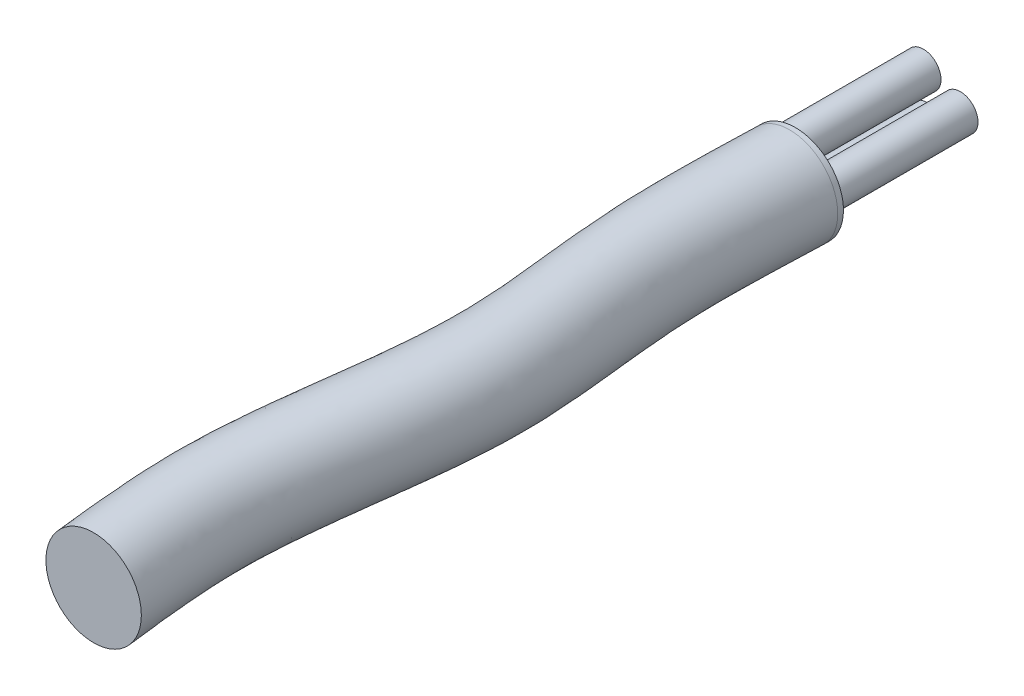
ISO-10303-21;
HEADER;
FILE_DESCRIPTION(('STEP AP214'),'2;1');
FILE_NAME('part.step','',(''),(''),'','','');
FILE_SCHEMA(('AUTOMOTIVE_DESIGN { 1 0 10303 214 1 1 1 1 }'));
ENDSEC;
DATA;
#1=APPLICATION_CONTEXT('core data for automotive mechanical design processes');
#2=APPLICATION_PROTOCOL_DEFINITION('international standard','automotive_design',2000,#1);
#3=PRODUCT_CONTEXT('',#1,'mechanical');
#4=PRODUCT('Part','Part','',(#3));
#5=PRODUCT_RELATED_PRODUCT_CATEGORY('part','',(#4));
#6=PRODUCT_DEFINITION_FORMATION('','',#4);
#7=PRODUCT_DEFINITION_CONTEXT('part definition',#1,'design');
#8=PRODUCT_DEFINITION('design','',#6,#7);
#9=PRODUCT_DEFINITION_SHAPE('','',#8);
#10=(LENGTH_UNIT() NAMED_UNIT(*) SI_UNIT(.MILLI.,.METRE.));
#11=(NAMED_UNIT(*) PLANE_ANGLE_UNIT() SI_UNIT($,.RADIAN.));
#12=(NAMED_UNIT(*) SI_UNIT($,.STERADIAN.) SOLID_ANGLE_UNIT());
#13=UNCERTAINTY_MEASURE_WITH_UNIT(LENGTH_MEASURE(1.E-05),#10,'distance_accuracy_value','');
#14=(GEOMETRIC_REPRESENTATION_CONTEXT(3) GLOBAL_UNCERTAINTY_ASSIGNED_CONTEXT((#13)) GLOBAL_UNIT_ASSIGNED_CONTEXT((#10,
#11,#12)) REPRESENTATION_CONTEXT('',''));
#15=CARTESIAN_POINT('',(0.,0.,0.));
#16=DIRECTION('',(0.,0.,1.));
#17=DIRECTION('',(1.,0.,0.));
#18=AXIS2_PLACEMENT_3D('',#15,#16,#17);
#19=CARTESIAN_POINT('',(-3.45791892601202,0.,-50.4254425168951));
#20=DIRECTION('',(0.,0.,0.999999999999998));
#21=DIRECTION('',(0.,-1.,0.));
#22=AXIS2_PLACEMENT_3D('',#19,#20,#21);
#23=PLANE('',#22);
#24=CARTESIAN_POINT('',(-0.689557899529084,-1.71483975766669,-50.4254425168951));
#25=DIRECTION('',(0.,0.,0.999999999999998));
#26=DIRECTION('',(0.,-1.,0.));
#27=AXIS2_PLACEMENT_3D('',#24,#25,#26);
#28=CIRCLE('',#27,1.27);
#29=CARTESIAN_POINT('',(-0.689557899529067,-2.98483975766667,-50.4254425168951));
#30=VERTEX_POINT('',#29);
#31=EDGE_CURVE('E24',#30,#30,#28,.F.);
#32=ORIENTED_EDGE('',*,*,#31,.F.);
#33=EDGE_LOOP('',(#32));
#34=FACE_BOUND('',#33,.T.);
#35=CARTESIAN_POINT('',(3.45791892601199,0.,-50.4254425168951));
#36=CARTESIAN_POINT('',(3.45791892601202,-6.85800000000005,-50.425442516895));
#37=CARTESIAN_POINT('',(-3.457918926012,-6.85799999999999,-50.4254425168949));
#38=CARTESIAN_POINT('',(-3.45791892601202,0.,-50.4254425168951));
#39=CARTESIAN_POINT('',(-3.457918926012,6.85799999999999,-50.425442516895));
#40=CARTESIAN_POINT('',(3.45791892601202,6.85799999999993,-50.425442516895));
#41=CARTESIAN_POINT('',(3.45791892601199,0.,-50.4254425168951));
#42=(BOUNDED_CURVE() B_SPLINE_CURVE(3,(#35,#36,#37,#38,#39,#40,#41),.UNSPECIFIED.,.T.,
.F.) B_SPLINE_CURVE_WITH_KNOTS((4,3,4),(0.,0.5,1.),
.UNSPECIFIED.) CURVE() GEOMETRIC_REPRESENTATION_ITEM() RATIONAL_B_SPLINE_CURVE((1.,
0.333333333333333,0.333333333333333,1.,0.333333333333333,0.333333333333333,1.)) REPRESENTATION_ITEM(''));
#43=CARTESIAN_POINT('',(3.45791892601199,0.,-50.4254425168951));
#44=VERTEX_POINT('',#43);
#45=EDGE_CURVE('E42',#44,#44,#42,.F.);
#46=ORIENTED_EDGE('',*,*,#45,.F.);
#47=EDGE_LOOP('',(#46));
#48=FACE_BOUND('',#47,.T.);
#49=CARTESIAN_POINT('',(1.69891733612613,0.161819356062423,-50.4254425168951));
#50=DIRECTION('',(0.,0.,0.999999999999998));
#51=DIRECTION('',(0.,-1.,0.));
#52=AXIS2_PLACEMENT_3D('',#49,#50,#51);
#53=CIRCLE('',#52,1.27);
#54=CARTESIAN_POINT('',(1.69891733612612,-1.10818064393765,-50.4254425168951));
#55=VERTEX_POINT('',#54);
#56=EDGE_CURVE('E28',#55,#55,#53,.F.);
#57=ORIENTED_EDGE('',*,*,#56,.F.);
#58=EDGE_LOOP('',(#57));
#59=FACE_BOUND('',#58,.T.);
#60=CARTESIAN_POINT('',(-0.95765205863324,1.47791795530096,-50.4254425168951));
#61=DIRECTION('',(0.,0.,0.999999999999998));
#62=DIRECTION('',(0.,-1.,0.));
#63=AXIS2_PLACEMENT_3D('',#60,#61,#62);
#64=CIRCLE('',#63,1.27);
#65=CARTESIAN_POINT('',(-0.957652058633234,0.207917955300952,-50.4254425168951));
#66=VERTEX_POINT('',#65);
#67=EDGE_CURVE('E10',#66,#66,#64,.F.);
#68=ORIENTED_EDGE('',*,*,#67,.F.);
#69=EDGE_LOOP('',(#68));
#70=FACE_BOUND('',#69,.T.);
#71=ADVANCED_FACE('F15',(#34,#48,#59,#70),#23,.F.);
#72=CARTESIAN_POINT('',(3.42899999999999,0.,0.));
#73=CARTESIAN_POINT('',(3.07501958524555,0.,-2.99527313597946));
#74=CARTESIAN_POINT('',(2.36671042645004,0.,-8.98876686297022));
#75=CARTESIAN_POINT('',(3.43309907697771,0.,-17.6937503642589));
#76=CARTESIAN_POINT('',(4.8285147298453,0.,-28.358811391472));
#77=CARTESIAN_POINT('',(3.02028988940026,0.,-38.8403067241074));
#78=CARTESIAN_POINT('',(3.3120914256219,0.,-46.2920632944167));
#79=CARTESIAN_POINT('',(3.45791892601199,0.,-50.0160705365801));
#80=CARTESIAN_POINT('',(3.42900000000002,6.85799999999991,0.));
#81=CARTESIAN_POINT('',(3.07501958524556,6.85799999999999,-2.99527313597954));
#82=CARTESIAN_POINT('',(2.36671042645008,6.85800000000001,-8.98876686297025));
#83=CARTESIAN_POINT('',(3.43309907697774,6.85799999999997,-17.6937503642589));
#84=CARTESIAN_POINT('',(4.82851472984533,6.85799999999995,-28.358811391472));
#85=CARTESIAN_POINT('',(3.02028988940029,6.85799999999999,-38.8403067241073));
#86=CARTESIAN_POINT('',(3.31209142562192,6.85799999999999,-46.2920632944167));
#87=CARTESIAN_POINT('',(3.45791892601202,6.85799999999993,-50.0160705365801));
#88=CARTESIAN_POINT('',(-3.42899999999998,6.85799999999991,0.));
#89=CARTESIAN_POINT('',(-3.78241312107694,6.85799999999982,-3.23216219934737));
#90=CARTESIAN_POINT('',(-4.48958713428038,6.85799999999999,-9.69966716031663));
#91=CARTESIAN_POINT('',(-3.12921139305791,6.85799999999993,-19.8261971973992));
#92=CARTESIAN_POINT('',(-2.06789855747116,6.85800000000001,-28.7395737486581));
#93=CARTESIAN_POINT('',(-3.80122567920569,6.85799999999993,-39.1997907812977));
#94=CARTESIAN_POINT('',(-3.57231619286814,6.85799999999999,-46.4924867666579));
#95=CARTESIAN_POINT('',(-3.457918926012,6.85799999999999,-50.1370036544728));
#96=CARTESIAN_POINT('',(-3.429,0.,0.));
#97=CARTESIAN_POINT('',(-3.78241312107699,0.,-3.2321621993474));
#98=CARTESIAN_POINT('',(-4.48958713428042,0.,-9.69966716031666));
#99=CARTESIAN_POINT('',(-3.12921139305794,0.,-19.8261971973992));
#100=CARTESIAN_POINT('',(-2.06789855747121,0.,-28.7395737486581));
#101=CARTESIAN_POINT('',(-3.80122567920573,0.,-39.1997907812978));
#102=CARTESIAN_POINT('',(-3.57231619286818,0.,-46.492486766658));
#103=CARTESIAN_POINT('',(-3.45791892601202,0.,-50.1370036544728));
#104=CARTESIAN_POINT('',(-3.42900000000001,-6.85800000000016,0.));
#105=CARTESIAN_POINT('',(-3.78241312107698,-6.85800000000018,-3.23216219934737));
#106=CARTESIAN_POINT('',(-4.48958713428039,-6.85799999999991,-9.69966716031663));
#107=CARTESIAN_POINT('',(-3.12921139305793,-6.85800000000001,-19.8261971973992));
#108=CARTESIAN_POINT('',(-2.06789855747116,-6.85800000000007,-28.7395737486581));
#109=CARTESIAN_POINT('',(-3.80122567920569,-6.85800000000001,-39.1997907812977));
#110=CARTESIAN_POINT('',(-3.57231619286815,-6.85800000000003,-46.4924867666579));
#111=CARTESIAN_POINT('',(-3.457918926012,-6.85799999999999,-50.1370036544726));
#112=CARTESIAN_POINT('',(3.42900000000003,-6.85800000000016,0.));
#113=CARTESIAN_POINT('',(3.07501958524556,-6.85800000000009,-2.99527313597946));
#114=CARTESIAN_POINT('',(2.36671042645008,-6.85800000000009,-8.98876686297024));
#115=CARTESIAN_POINT('',(3.4330990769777,-6.85799999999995,-17.6937503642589));
#116=CARTESIAN_POINT('',(4.82851472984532,-6.85799999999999,-28.358811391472));
#117=CARTESIAN_POINT('',(3.02028988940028,-6.85799999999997,-38.8403067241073));
#118=CARTESIAN_POINT('',(3.31209142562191,-6.85799999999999,-46.2920632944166));
#119=CARTESIAN_POINT('',(3.45791892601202,-6.85800000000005,-50.01607053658));
#120=CARTESIAN_POINT('',(3.42899999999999,0.,0.));
#121=CARTESIAN_POINT('',(3.07501958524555,0.,-2.99527313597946));
#122=CARTESIAN_POINT('',(2.36671042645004,0.,-8.98876686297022));
#123=CARTESIAN_POINT('',(3.43309907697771,0.,-17.6937503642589));
#124=CARTESIAN_POINT('',(4.8285147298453,0.,-28.358811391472));
#125=CARTESIAN_POINT('',(3.02028988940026,0.,-38.8403067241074));
#126=CARTESIAN_POINT('',(3.3120914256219,0.,-46.2920632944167));
#127=CARTESIAN_POINT('',(3.45791892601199,0.,-50.0160705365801));
#128=(BOUNDED_SURFACE() B_SPLINE_SURFACE(3,3,((#72,#73,#74,#75,#76,#77,#78,#79),(#80,#81,#82,
#83,#84,#85,#86,#87),(#88,#89,#90,#91,#92,#93,#94,#95),(#96,#97,#98,#99,#100,#101,#102,#103),
(#104,#105,#106,#107,#108,#109,#110,#111),(#112,#113,#114,#115,#116,#117,#118,#119),(#120,#121,
#122,#123,#124,#125,#126,#127)),.UNSPECIFIED.,.T.,.F.,.F.) B_SPLINE_SURFACE_WITH_KNOTS((4,3,4),
(4,1,1,1,1,4),(0.,0.5,1.),(0.,0.185525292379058,0.371233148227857,0.559124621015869,
0.779673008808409,1.),
.UNSPECIFIED.) GEOMETRIC_REPRESENTATION_ITEM() RATIONAL_B_SPLINE_SURFACE(((1.,1.,1.,1.,1.,1.,1.,
1.),(0.333333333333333,0.333333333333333,0.333333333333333,0.333333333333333,0.333333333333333,
0.333333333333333,0.333333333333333,0.333333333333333),(0.333333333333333,0.333333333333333,
0.333333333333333,0.333333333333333,0.333333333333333,0.333333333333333,0.333333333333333,
0.333333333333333),(1.,1.,1.,1.,1.,1.,1.,1.),(0.333333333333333,0.333333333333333,
0.333333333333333,0.333333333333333,0.333333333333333,0.333333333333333,0.333333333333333,
0.333333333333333),(0.333333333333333,0.333333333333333,0.333333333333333,0.333333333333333,
0.333333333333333,0.333333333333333,0.333333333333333,0.333333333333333),(1.,1.,1.,1.,1.,1.,1.,1.))) REPRESENTATION_ITEM('') SURFACE());
#129=CARTESIAN_POINT('',(0.,0.,0.));
#130=DIRECTION('',(0.,0.,0.999999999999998));
#131=DIRECTION('',(1.,0.,0.));
#132=AXIS2_PLACEMENT_3D('',#129,#130,#131);
#133=CIRCLE('',#132,3.429);
#134=CARTESIAN_POINT('',(3.429,0.,0.));
#135=VERTEX_POINT('',#134);
#136=EDGE_CURVE('E32',#135,#135,#133,.T.);
#137=CARTESIAN_POINT('',(3.45791892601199,0.,-50.0160705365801));
#138=CARTESIAN_POINT('',(3.45791892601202,6.85799999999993,-50.0160705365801));
#139=CARTESIAN_POINT('',(-3.457918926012,6.85799999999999,-50.1370036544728));
#140=CARTESIAN_POINT('',(-3.45791892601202,0.,-50.1370036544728));
#141=CARTESIAN_POINT('',(-3.457918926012,-6.85799999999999,-50.1370036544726));
#142=CARTESIAN_POINT('',(3.45791892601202,-6.85800000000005,-50.01607053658));
#143=CARTESIAN_POINT('',(3.45791892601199,0.,-50.0160705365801));
#144=(BOUNDED_CURVE() B_SPLINE_CURVE(3,(#137,#138,#139,#140,#141,#142,#143),.UNSPECIFIED.,.T.,
.F.) B_SPLINE_CURVE_WITH_KNOTS((4,3,4),(0.,0.5,1.),
.UNSPECIFIED.) CURVE() GEOMETRIC_REPRESENTATION_ITEM() RATIONAL_B_SPLINE_CURVE((1.,
0.333333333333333,0.333333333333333,1.,0.333333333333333,0.333333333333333,1.)) REPRESENTATION_ITEM(''));
#145=CARTESIAN_POINT('',(3.45791892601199,0.,-50.0160705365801));
#146=VERTEX_POINT('',#145);
#147=EDGE_CURVE('E37',#146,#146,#144,.F.);
#148=ORIENTED_EDGE('',*,*,#136,.F.);
#149=EDGE_LOOP('',(#148));
#150=FACE_BOUND('',#149,.T.);
#151=ORIENTED_EDGE('',*,*,#147,.F.);
#152=EDGE_LOOP('',(#151));
#153=FACE_BOUND('',#152,.T.);
#154=ADVANCED_FACE('F17',(#150,#153),#128,.F.);
#155=CARTESIAN_POINT('',(0.,0.,0.));
#156=DIRECTION('',(0.,0.,0.999999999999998));
#157=DIRECTION('',(1.,0.,0.));
#158=AXIS2_PLACEMENT_3D('',#155,#156,#157);
#159=PLANE('',#158);
#160=ORIENTED_EDGE('',*,*,#136,.T.);
#161=EDGE_LOOP('',(#160));
#162=FACE_BOUND('',#161,.T.);
#163=ADVANCED_FACE('F82',(#162),#159,.T.);
#164=CARTESIAN_POINT('',(3.45791892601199,0.,-50.0160705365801));
#165=CARTESIAN_POINT('',(3.45791892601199,0.,-50.4254425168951));
#166=CARTESIAN_POINT('',(3.45791892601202,-6.85800000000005,-50.01607053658));
#167=CARTESIAN_POINT('',(3.45791892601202,-6.85800000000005,-50.425442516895));
#168=CARTESIAN_POINT('',(-3.457918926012,-6.85799999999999,-50.1370036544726));
#169=CARTESIAN_POINT('',(-3.457918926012,-6.85799999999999,-50.4254425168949));
#170=CARTESIAN_POINT('',(-3.45791892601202,0.,-50.1370036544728));
#171=CARTESIAN_POINT('',(-3.45791892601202,0.,-50.4254425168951));
#172=CARTESIAN_POINT('',(-3.457918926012,6.85799999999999,-50.1370036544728));
#173=CARTESIAN_POINT('',(-3.457918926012,6.85799999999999,-50.425442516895));
#174=CARTESIAN_POINT('',(3.45791892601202,6.85799999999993,-50.0160705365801));
#175=CARTESIAN_POINT('',(3.45791892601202,6.85799999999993,-50.425442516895));
#176=CARTESIAN_POINT('',(3.45791892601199,0.,-50.0160705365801));
#177=CARTESIAN_POINT('',(3.45791892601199,0.,-50.4254425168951));
#178=(BOUNDED_SURFACE() B_SPLINE_SURFACE(3,1,((#164,#165),(#166,#167),(#168,#169),(#170,#171),
(#172,#173),(#174,#175),(#176,#177)),.UNSPECIFIED.,.T.,.F.,.F.) B_SPLINE_SURFACE_WITH_KNOTS((4,
3,4),(2,2),(0.,0.5,1.),(0.,1.),
.UNSPECIFIED.) GEOMETRIC_REPRESENTATION_ITEM() RATIONAL_B_SPLINE_SURFACE(((1.,1.),
(0.333333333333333,0.333333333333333),(0.333333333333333,0.333333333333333),(1.,1.),
(0.333333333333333,0.333333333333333),(0.333333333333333,0.333333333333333),(1.,1.))) REPRESENTATION_ITEM('') SURFACE());
#179=ORIENTED_EDGE('',*,*,#147,.T.);
#180=EDGE_LOOP('',(#179));
#181=FACE_BOUND('',#180,.T.);
#182=ORIENTED_EDGE('',*,*,#45,.T.);
#183=EDGE_LOOP('',(#182));
#184=FACE_BOUND('',#183,.T.);
#185=ADVANCED_FACE('F88',(#181,#184),#178,.T.);
#186=CARTESIAN_POINT('',(1.69891733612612,0.16181935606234,-60.5854425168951));
#187=DIRECTION('',(0.,0.,0.999999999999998));
#188=DIRECTION('',(0.,-1.,0.));
#189=AXIS2_PLACEMENT_3D('',#186,#187,#188);
#190=CYLINDRICAL_SURFACE('',#189,1.27);
#191=CARTESIAN_POINT('',(1.69891733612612,0.16181935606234,-60.5854425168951));
#192=DIRECTION('',(0.,0.,-0.999999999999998));
#193=DIRECTION('',(0.,1.,0.));
#194=AXIS2_PLACEMENT_3D('',#191,#192,#193);
#195=CIRCLE('',#194,1.27);
#196=CARTESIAN_POINT('',(1.69891733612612,-1.10818064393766,-60.5854425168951));
#197=VERTEX_POINT('',#196);
#198=EDGE_CURVE('E50',#197,#197,#195,.T.);
#199=CARTESIAN_POINT('',(1.69891733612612,-1.10818064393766,-60.5854425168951));
#200=CARTESIAN_POINT('',(1.69891733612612,-1.10818064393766,-60.4796091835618));
#201=CARTESIAN_POINT('',(1.69891733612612,-1.10818064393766,-60.3737758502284));
#202=CARTESIAN_POINT('',(1.69891733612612,-1.10818064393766,-60.1621091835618));
#203=CARTESIAN_POINT('',(1.69891733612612,-1.10818064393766,-60.0562758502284));
#204=CARTESIAN_POINT('',(1.69891733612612,-1.10818064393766,-59.8446091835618));
#205=CARTESIAN_POINT('',(1.69891733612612,-1.10818064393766,-59.7387758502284));
#206=CARTESIAN_POINT('',(1.69891733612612,-1.10818064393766,-59.5271091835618));
#207=CARTESIAN_POINT('',(1.69891733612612,-1.10818064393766,-59.4212758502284));
#208=CARTESIAN_POINT('',(1.69891733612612,-1.10818064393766,-59.2096091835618));
#209=CARTESIAN_POINT('',(1.69891733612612,-1.10818064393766,-59.1037758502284));
#210=CARTESIAN_POINT('',(1.69891733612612,-1.10818064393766,-58.8921091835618));
#211=CARTESIAN_POINT('',(1.69891733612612,-1.10818064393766,-58.7862758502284));
#212=CARTESIAN_POINT('',(1.69891733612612,-1.10818064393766,-58.5746091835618));
#213=CARTESIAN_POINT('',(1.69891733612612,-1.10818064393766,-58.4687758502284));
#214=CARTESIAN_POINT('',(1.69891733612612,-1.10818064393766,-58.2571091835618));
#215=CARTESIAN_POINT('',(1.69891733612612,-1.10818064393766,-58.1512758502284));
#216=CARTESIAN_POINT('',(1.69891733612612,-1.10818064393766,-57.9396091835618));
#217=CARTESIAN_POINT('',(1.69891733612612,-1.10818064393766,-57.8337758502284));
#218=CARTESIAN_POINT('',(1.69891733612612,-1.10818064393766,-57.6221091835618));
#219=CARTESIAN_POINT('',(1.69891733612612,-1.10818064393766,-57.5162758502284));
#220=CARTESIAN_POINT('',(1.69891733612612,-1.10818064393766,-57.3046091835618));
#221=CARTESIAN_POINT('',(1.69891733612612,-1.10818064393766,-57.1987758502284));
#222=CARTESIAN_POINT('',(1.69891733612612,-1.10818064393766,-56.9871091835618));
#223=CARTESIAN_POINT('',(1.69891733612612,-1.10818064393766,-56.8812758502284));
#224=CARTESIAN_POINT('',(1.69891733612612,-1.10818064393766,-56.6696091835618));
#225=CARTESIAN_POINT('',(1.69891733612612,-1.10818064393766,-56.5637758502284));
#226=CARTESIAN_POINT('',(1.69891733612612,-1.10818064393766,-56.3521091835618));
#227=CARTESIAN_POINT('',(1.69891733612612,-1.10818064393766,-56.2462758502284));
#228=CARTESIAN_POINT('',(1.69891733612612,-1.10818064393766,-56.0346091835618));
#229=CARTESIAN_POINT('',(1.69891733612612,-1.10818064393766,-55.9287758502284));
#230=CARTESIAN_POINT('',(1.69891733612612,-1.10818064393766,-55.7171091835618));
#231=CARTESIAN_POINT('',(1.69891733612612,-1.10818064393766,-55.6112758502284));
#232=CARTESIAN_POINT('',(1.69891733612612,-1.10818064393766,-55.3996091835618));
#233=CARTESIAN_POINT('',(1.69891733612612,-1.10818064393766,-55.2937758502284));
#234=CARTESIAN_POINT('',(1.69891733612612,-1.10818064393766,-55.0821091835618));
#235=CARTESIAN_POINT('',(1.69891733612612,-1.10818064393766,-54.9762758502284));
#236=CARTESIAN_POINT('',(1.69891733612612,-1.10818064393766,-54.7646091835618));
#237=CARTESIAN_POINT('',(1.69891733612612,-1.10818064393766,-54.6587758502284));
#238=CARTESIAN_POINT('',(1.69891733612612,-1.10818064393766,-54.4471091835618));
#239=CARTESIAN_POINT('',(1.69891733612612,-1.10818064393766,-54.3412758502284));
#240=CARTESIAN_POINT('',(1.69891733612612,-1.10818064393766,-54.1296091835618));
#241=CARTESIAN_POINT('',(1.69891733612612,-1.10818064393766,-54.0237758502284));
#242=CARTESIAN_POINT('',(1.69891733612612,-1.10818064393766,-53.8121091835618));
#243=CARTESIAN_POINT('',(1.69891733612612,-1.10818064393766,-53.7062758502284));
#244=CARTESIAN_POINT('',(1.69891733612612,-1.10818064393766,-53.4946091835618));
#245=CARTESIAN_POINT('',(1.69891733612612,-1.10818064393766,-53.3887758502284));
#246=CARTESIAN_POINT('',(1.69891733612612,-1.10818064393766,-53.1771091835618));
#247=CARTESIAN_POINT('',(1.69891733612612,-1.10818064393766,-53.0712758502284));
#248=CARTESIAN_POINT('',(1.69891733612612,-1.10818064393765,-52.8596091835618));
#249=CARTESIAN_POINT('',(1.69891733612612,-1.10818064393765,-52.7537758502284));
#250=CARTESIAN_POINT('',(1.69891733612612,-1.10818064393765,-52.5421091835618));
#251=CARTESIAN_POINT('',(1.69891733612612,-1.10818064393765,-52.4362758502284));
#252=CARTESIAN_POINT('',(1.69891733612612,-1.10818064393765,-52.2246091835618));
#253=CARTESIAN_POINT('',(1.69891733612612,-1.10818064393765,-52.1187758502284));
#254=CARTESIAN_POINT('',(1.69891733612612,-1.10818064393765,-51.9071091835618));
#255=CARTESIAN_POINT('',(1.69891733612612,-1.10818064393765,-51.8012758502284));
#256=CARTESIAN_POINT('',(1.69891733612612,-1.10818064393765,-51.5896091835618));
#257=CARTESIAN_POINT('',(1.69891733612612,-1.10818064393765,-51.4837758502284));
#258=CARTESIAN_POINT('',(1.69891733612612,-1.10818064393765,-51.2721091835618));
#259=CARTESIAN_POINT('',(1.69891733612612,-1.10818064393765,-51.1662758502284));
#260=CARTESIAN_POINT('',(1.69891733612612,-1.10818064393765,-50.9546091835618));
#261=CARTESIAN_POINT('',(1.69891733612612,-1.10818064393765,-50.8487758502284));
#262=CARTESIAN_POINT('',(1.69891733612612,-1.10818064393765,-50.6371091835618));
#263=CARTESIAN_POINT('',(1.69891733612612,-1.10818064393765,-50.5312758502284));
#264=CARTESIAN_POINT('',(1.69891733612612,-1.10818064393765,-50.4254425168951));
#265=B_SPLINE_CURVE_WITH_KNOTS('',3,(#199,#200,#201,#202,#203,#204,#205,#206,#207,#208,#209,
#210,#211,#212,#213,#214,#215,#216,#217,#218,#219,#220,#221,#222,#223,#224,#225,#226,#227,#228,
#229,#230,#231,#232,#233,#234,#235,#236,#237,#238,#239,#240,#241,#242,#243,#244,#245,#246,#247,
#248,#249,#250,#251,#252,#253,#254,#255,#256,#257,#258,#259,#260,#261,#262,#263,#264),
.UNSPECIFIED.,.F.,.F.,(4,2,2,2,2,2,2,2,2,2,2,2,2,2,2,2,2,2,2,2,2,2,2,2,2,2,2,2,2,2,2,2,4),(0.,
0.317500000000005,0.635000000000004,0.952500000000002,1.27000000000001,1.58750000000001,1.905,
2.2225,2.54,2.85750000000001,3.175,3.4925,3.81,4.12750000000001,4.445,4.7625,5.08,
5.39750000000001,5.71500000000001,6.0325,6.35,6.66750000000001,6.985,7.3025,7.62,
7.93750000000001,8.25500000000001,8.5725,8.89000000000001,9.20750000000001,9.52500000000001,
9.8425,10.16),.UNSPECIFIED.);
#266=EDGE_CURVE('BSEAM97',#197,#55,#265,.T.);
#267=ORIENTED_EDGE('',*,*,#198,.F.);
#268=ORIENTED_EDGE('',*,*,#56,.T.);
#269=ORIENTED_EDGE('',*,*,#266,.T.);
#270=ORIENTED_EDGE('',*,*,#266,.F.);
#271=EDGE_LOOP('',(#267,#269,#268,#270));
#272=FACE_BOUND('',#271,.T.);
#273=ADVANCED_FACE('F97',(#272),#190,.T.);
#274=CARTESIAN_POINT('',(1.69891733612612,0.16181935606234,-60.5854425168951));
#275=DIRECTION('',(0.,0.,-0.999999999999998));
#276=DIRECTION('',(0.,1.,0.));
#277=AXIS2_PLACEMENT_3D('',#274,#275,#276);
#278=PLANE('',#277);
#279=ORIENTED_EDGE('',*,*,#198,.T.);
#280=EDGE_LOOP('',(#279));
#281=FACE_BOUND('',#280,.T.);
#282=ADVANCED_FACE('F109',(#281),#278,.T.);
#283=CARTESIAN_POINT('',(-0.689557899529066,-1.71483975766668,-60.5854425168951));
#284=DIRECTION('',(0.,0.,0.999999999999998));
#285=DIRECTION('',(0.,-1.,0.));
#286=AXIS2_PLACEMENT_3D('',#283,#284,#285);
#287=CYLINDRICAL_SURFACE('',#286,1.27);
#288=CARTESIAN_POINT('',(-0.689557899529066,-1.71483975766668,-60.5854425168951));
#289=DIRECTION('',(0.,0.,-0.999999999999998));
#290=DIRECTION('',(0.,1.,0.));
#291=AXIS2_PLACEMENT_3D('',#288,#289,#290);
#292=CIRCLE('',#291,1.27);
#293=CARTESIAN_POINT('',(-0.689557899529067,-2.98483975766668,-60.5854425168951));
#294=VERTEX_POINT('',#293);
#295=EDGE_CURVE('E56',#294,#294,#292,.T.);
#296=CARTESIAN_POINT('',(-0.689557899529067,-2.98483975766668,-60.5854425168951));
#297=CARTESIAN_POINT('',(-0.689557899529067,-2.98483975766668,-60.4796091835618));
#298=CARTESIAN_POINT('',(-0.689557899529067,-2.98483975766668,-60.3737758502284));
#299=CARTESIAN_POINT('',(-0.689557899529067,-2.98483975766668,-60.1621091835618));
#300=CARTESIAN_POINT('',(-0.689557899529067,-2.98483975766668,-60.0562758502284));
#301=CARTESIAN_POINT('',(-0.689557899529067,-2.98483975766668,-59.8446091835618));
#302=CARTESIAN_POINT('',(-0.689557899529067,-2.98483975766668,-59.7387758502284));
#303=CARTESIAN_POINT('',(-0.689557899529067,-2.98483975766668,-59.5271091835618));
#304=CARTESIAN_POINT('',(-0.689557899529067,-2.98483975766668,-59.4212758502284));
#305=CARTESIAN_POINT('',(-0.689557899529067,-2.98483975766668,-59.2096091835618));
#306=CARTESIAN_POINT('',(-0.689557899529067,-2.98483975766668,-59.1037758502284));
#307=CARTESIAN_POINT('',(-0.689557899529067,-2.98483975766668,-58.8921091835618));
#308=CARTESIAN_POINT('',(-0.689557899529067,-2.98483975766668,-58.7862758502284));
#309=CARTESIAN_POINT('',(-0.689557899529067,-2.98483975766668,-58.5746091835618));
#310=CARTESIAN_POINT('',(-0.689557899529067,-2.98483975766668,-58.4687758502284));
#311=CARTESIAN_POINT('',(-0.689557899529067,-2.98483975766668,-58.2571091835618));
#312=CARTESIAN_POINT('',(-0.689557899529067,-2.98483975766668,-58.1512758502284));
#313=CARTESIAN_POINT('',(-0.689557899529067,-2.98483975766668,-57.9396091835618));
#314=CARTESIAN_POINT('',(-0.689557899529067,-2.98483975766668,-57.8337758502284));
#315=CARTESIAN_POINT('',(-0.689557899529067,-2.98483975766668,-57.6221091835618));
#316=CARTESIAN_POINT('',(-0.689557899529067,-2.98483975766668,-57.5162758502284));
#317=CARTESIAN_POINT('',(-0.689557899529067,-2.98483975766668,-57.3046091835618));
#318=CARTESIAN_POINT('',(-0.689557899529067,-2.98483975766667,-57.1987758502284));
#319=CARTESIAN_POINT('',(-0.689557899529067,-2.98483975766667,-56.9871091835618));
#320=CARTESIAN_POINT('',(-0.689557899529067,-2.98483975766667,-56.8812758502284));
#321=CARTESIAN_POINT('',(-0.689557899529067,-2.98483975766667,-56.6696091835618));
#322=CARTESIAN_POINT('',(-0.689557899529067,-2.98483975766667,-56.5637758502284));
#323=CARTESIAN_POINT('',(-0.689557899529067,-2.98483975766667,-56.3521091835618));
#324=CARTESIAN_POINT('',(-0.689557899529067,-2.98483975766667,-56.2462758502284));
#325=CARTESIAN_POINT('',(-0.689557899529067,-2.98483975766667,-56.0346091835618));
#326=CARTESIAN_POINT('',(-0.689557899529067,-2.98483975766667,-55.9287758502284));
#327=CARTESIAN_POINT('',(-0.689557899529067,-2.98483975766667,-55.7171091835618));
#328=CARTESIAN_POINT('',(-0.689557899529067,-2.98483975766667,-55.6112758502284));
#329=CARTESIAN_POINT('',(-0.689557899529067,-2.98483975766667,-55.3996091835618));
#330=CARTESIAN_POINT('',(-0.689557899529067,-2.98483975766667,-55.2937758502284));
#331=CARTESIAN_POINT('',(-0.689557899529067,-2.98483975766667,-55.0821091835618));
#332=CARTESIAN_POINT('',(-0.689557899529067,-2.98483975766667,-54.9762758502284));
#333=CARTESIAN_POINT('',(-0.689557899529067,-2.98483975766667,-54.7646091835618));
#334=CARTESIAN_POINT('',(-0.689557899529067,-2.98483975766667,-54.6587758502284));
#335=CARTESIAN_POINT('',(-0.689557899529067,-2.98483975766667,-54.4471091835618));
#336=CARTESIAN_POINT('',(-0.689557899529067,-2.98483975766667,-54.3412758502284));
#337=CARTESIAN_POINT('',(-0.689557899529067,-2.98483975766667,-54.1296091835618));
#338=CARTESIAN_POINT('',(-0.689557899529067,-2.98483975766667,-54.0237758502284));
#339=CARTESIAN_POINT('',(-0.689557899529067,-2.98483975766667,-53.8121091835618));
#340=CARTESIAN_POINT('',(-0.689557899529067,-2.98483975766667,-53.7062758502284));
#341=CARTESIAN_POINT('',(-0.689557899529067,-2.98483975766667,-53.4946091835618));
#342=CARTESIAN_POINT('',(-0.689557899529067,-2.98483975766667,-53.3887758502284));
#343=CARTESIAN_POINT('',(-0.689557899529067,-2.98483975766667,-53.1771091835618));
#344=CARTESIAN_POINT('',(-0.689557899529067,-2.98483975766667,-53.0712758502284));
#345=CARTESIAN_POINT('',(-0.689557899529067,-2.98483975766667,-52.8596091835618));
#346=CARTESIAN_POINT('',(-0.689557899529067,-2.98483975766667,-52.7537758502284));
#347=CARTESIAN_POINT('',(-0.689557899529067,-2.98483975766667,-52.5421091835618));
#348=CARTESIAN_POINT('',(-0.689557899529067,-2.98483975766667,-52.4362758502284));
#349=CARTESIAN_POINT('',(-0.689557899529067,-2.98483975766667,-52.2246091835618));
#350=CARTESIAN_POINT('',(-0.689557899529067,-2.98483975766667,-52.1187758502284));
#351=CARTESIAN_POINT('',(-0.689557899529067,-2.98483975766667,-51.9071091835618));
#352=CARTESIAN_POINT('',(-0.689557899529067,-2.98483975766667,-51.8012758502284));
#353=CARTESIAN_POINT('',(-0.689557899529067,-2.98483975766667,-51.5896091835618));
#354=CARTESIAN_POINT('',(-0.689557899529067,-2.98483975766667,-51.4837758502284));
#355=CARTESIAN_POINT('',(-0.689557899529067,-2.98483975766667,-51.2721091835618));
#356=CARTESIAN_POINT('',(-0.689557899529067,-2.98483975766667,-51.1662758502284));
#357=CARTESIAN_POINT('',(-0.689557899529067,-2.98483975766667,-50.9546091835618));
#358=CARTESIAN_POINT('',(-0.689557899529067,-2.98483975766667,-50.8487758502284));
#359=CARTESIAN_POINT('',(-0.689557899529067,-2.98483975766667,-50.6371091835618));
#360=CARTESIAN_POINT('',(-0.689557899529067,-2.98483975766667,-50.5312758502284));
#361=CARTESIAN_POINT('',(-0.689557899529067,-2.98483975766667,-50.4254425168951));
#362=B_SPLINE_CURVE_WITH_KNOTS('',3,(#296,#297,#298,#299,#300,#301,#302,#303,#304,#305,#306,
#307,#308,#309,#310,#311,#312,#313,#314,#315,#316,#317,#318,#319,#320,#321,#322,#323,#324,#325,
#326,#327,#328,#329,#330,#331,#332,#333,#334,#335,#336,#337,#338,#339,#340,#341,#342,#343,#344,
#345,#346,#347,#348,#349,#350,#351,#352,#353,#354,#355,#356,#357,#358,#359,#360,#361),
.UNSPECIFIED.,.F.,.F.,(4,2,2,2,2,2,2,2,2,2,2,2,2,2,2,2,2,2,2,2,2,2,2,2,2,2,2,2,2,2,2,2,4),(0.,
0.317500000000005,0.635000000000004,0.952500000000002,1.27000000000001,1.58750000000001,1.905,
2.2225,2.54,2.85750000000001,3.175,3.4925,3.81,4.12750000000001,4.445,4.7625,5.08,
5.39750000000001,5.71500000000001,6.0325,6.35,6.66750000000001,6.985,7.3025,7.62,
7.93750000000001,8.25500000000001,8.5725,8.89000000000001,9.20750000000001,9.52500000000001,
9.8425,10.16),.UNSPECIFIED.);
#363=EDGE_CURVE('BSEAM76',#294,#30,#362,.T.);
#364=ORIENTED_EDGE('',*,*,#295,.F.);
#365=ORIENTED_EDGE('',*,*,#31,.T.);
#366=ORIENTED_EDGE('',*,*,#363,.T.);
#367=ORIENTED_EDGE('',*,*,#363,.F.);
#368=EDGE_LOOP('',(#364,#366,#365,#367));
#369=FACE_BOUND('',#368,.T.);
#370=ADVANCED_FACE('F76',(#369),#287,.T.);
#371=CARTESIAN_POINT('',(-0.689557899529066,-1.71483975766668,-60.5854425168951));
#372=DIRECTION('',(0.,0.,-0.999999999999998));
#373=DIRECTION('',(0.,1.,0.));
#374=AXIS2_PLACEMENT_3D('',#371,#372,#373);
#375=PLANE('',#374);
#376=ORIENTED_EDGE('',*,*,#295,.T.);
#377=EDGE_LOOP('',(#376));
#378=FACE_BOUND('',#377,.T.);
#379=ADVANCED_FACE('F67',(#378),#375,.T.);
#380=CARTESIAN_POINT('',(-0.957652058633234,1.47791795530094,-60.5854425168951));
#381=DIRECTION('',(0.,0.,0.999999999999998));
#382=DIRECTION('',(0.,-1.,0.));
#383=AXIS2_PLACEMENT_3D('',#380,#381,#382);
#384=CYLINDRICAL_SURFACE('',#383,1.27);
#385=CARTESIAN_POINT('',(-0.957652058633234,1.47791795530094,-60.5854425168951));
#386=DIRECTION('',(0.,0.,-0.999999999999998));
#387=DIRECTION('',(0.,1.,0.));
#388=AXIS2_PLACEMENT_3D('',#385,#386,#387);
#389=CIRCLE('',#388,1.27);
#390=CARTESIAN_POINT('',(-0.957652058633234,0.207917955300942,-60.5854425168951));
#391=VERTEX_POINT('',#390);
#392=EDGE_CURVE('E59',#391,#391,#389,.T.);
#393=CARTESIAN_POINT('',(-0.957652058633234,0.207917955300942,-60.5854425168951));
#394=CARTESIAN_POINT('',(-0.957652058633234,0.207917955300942,-60.4796091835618));
#395=CARTESIAN_POINT('',(-0.957652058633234,0.207917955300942,-60.3737758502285));
#396=CARTESIAN_POINT('',(-0.957652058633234,0.207917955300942,-60.1621091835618));
#397=CARTESIAN_POINT('',(-0.957652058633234,0.207917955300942,-60.0562758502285));
#398=CARTESIAN_POINT('',(-0.957652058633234,0.207917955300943,-59.8446091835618));
#399=CARTESIAN_POINT('',(-0.957652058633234,0.207917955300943,-59.7387758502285));
#400=CARTESIAN_POINT('',(-0.957652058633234,0.207917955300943,-59.5271091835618));
#401=CARTESIAN_POINT('',(-0.957652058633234,0.207917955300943,-59.4212758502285));
#402=CARTESIAN_POINT('',(-0.957652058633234,0.207917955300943,-59.2096091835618));
#403=CARTESIAN_POINT('',(-0.957652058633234,0.207917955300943,-59.1037758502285));
#404=CARTESIAN_POINT('',(-0.957652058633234,0.207917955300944,-58.8921091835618));
#405=CARTESIAN_POINT('',(-0.957652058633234,0.207917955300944,-58.7862758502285));
#406=CARTESIAN_POINT('',(-0.957652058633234,0.207917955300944,-58.5746091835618));
#407=CARTESIAN_POINT('',(-0.957652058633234,0.207917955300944,-58.4687758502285));
#408=CARTESIAN_POINT('',(-0.957652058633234,0.207917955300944,-58.2571091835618));
#409=CARTESIAN_POINT('',(-0.957652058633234,0.207917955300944,-58.1512758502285));
#410=CARTESIAN_POINT('',(-0.957652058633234,0.207917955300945,-57.9396091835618));
#411=CARTESIAN_POINT('',(-0.957652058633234,0.207917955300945,-57.8337758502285));
#412=CARTESIAN_POINT('',(-0.957652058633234,0.207917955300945,-57.6221091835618));
#413=CARTESIAN_POINT('',(-0.957652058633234,0.207917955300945,-57.5162758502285));
#414=CARTESIAN_POINT('',(-0.957652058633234,0.207917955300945,-57.3046091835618));
#415=CARTESIAN_POINT('',(-0.957652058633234,0.207917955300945,-57.1987758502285));
#416=CARTESIAN_POINT('',(-0.957652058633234,0.207917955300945,-56.9871091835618));
#417=CARTESIAN_POINT('',(-0.957652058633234,0.207917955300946,-56.8812758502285));
#418=CARTESIAN_POINT('',(-0.957652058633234,0.207917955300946,-56.6696091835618));
#419=CARTESIAN_POINT('',(-0.957652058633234,0.207917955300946,-56.5637758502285));
#420=CARTESIAN_POINT('',(-0.957652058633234,0.207917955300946,-56.3521091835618));
#421=CARTESIAN_POINT('',(-0.957652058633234,0.207917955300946,-56.2462758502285));
#422=CARTESIAN_POINT('',(-0.957652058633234,0.207917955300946,-56.0346091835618));
#423=CARTESIAN_POINT('',(-0.957652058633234,0.207917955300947,-55.9287758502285));
#424=CARTESIAN_POINT('',(-0.957652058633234,0.207917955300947,-55.7171091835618));
#425=CARTESIAN_POINT('',(-0.957652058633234,0.207917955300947,-55.6112758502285));
#426=CARTESIAN_POINT('',(-0.957652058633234,0.207917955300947,-55.3996091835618));
#427=CARTESIAN_POINT('',(-0.957652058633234,0.207917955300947,-55.2937758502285));
#428=CARTESIAN_POINT('',(-0.957652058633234,0.207917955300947,-55.0821091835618));
#429=CARTESIAN_POINT('',(-0.957652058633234,0.207917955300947,-54.9762758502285));
#430=CARTESIAN_POINT('',(-0.957652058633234,0.207917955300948,-54.7646091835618));
#431=CARTESIAN_POINT('',(-0.957652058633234,0.207917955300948,-54.6587758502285));
#432=CARTESIAN_POINT('',(-0.957652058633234,0.207917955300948,-54.4471091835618));
#433=CARTESIAN_POINT('',(-0.957652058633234,0.207917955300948,-54.3412758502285));
#434=CARTESIAN_POINT('',(-0.957652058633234,0.207917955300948,-54.1296091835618));
#435=CARTESIAN_POINT('',(-0.957652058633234,0.207917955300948,-54.0237758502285));
#436=CARTESIAN_POINT('',(-0.957652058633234,0.207917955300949,-53.8121091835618));
#437=CARTESIAN_POINT('',(-0.957652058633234,0.207917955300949,-53.7062758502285));
#438=CARTESIAN_POINT('',(-0.957652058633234,0.207917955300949,-53.4946091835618));
#439=CARTESIAN_POINT('',(-0.957652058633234,0.207917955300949,-53.3887758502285));
#440=CARTESIAN_POINT('',(-0.957652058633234,0.207917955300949,-53.1771091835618));
#441=CARTESIAN_POINT('',(-0.957652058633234,0.207917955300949,-53.0712758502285));
#442=CARTESIAN_POINT('',(-0.957652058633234,0.20791795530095,-52.8596091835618));
#443=CARTESIAN_POINT('',(-0.957652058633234,0.20791795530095,-52.7537758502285));
#444=CARTESIAN_POINT('',(-0.957652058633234,0.20791795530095,-52.5421091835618));
#445=CARTESIAN_POINT('',(-0.957652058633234,0.20791795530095,-52.4362758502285));
#446=CARTESIAN_POINT('',(-0.957652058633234,0.20791795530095,-52.2246091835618));
#447=CARTESIAN_POINT('',(-0.957652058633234,0.20791795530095,-52.1187758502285));
#448=CARTESIAN_POINT('',(-0.957652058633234,0.207917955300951,-51.9071091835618));
#449=CARTESIAN_POINT('',(-0.957652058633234,0.207917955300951,-51.8012758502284));
#450=CARTESIAN_POINT('',(-0.957652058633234,0.207917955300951,-51.5896091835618));
#451=CARTESIAN_POINT('',(-0.957652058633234,0.207917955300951,-51.4837758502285));
#452=CARTESIAN_POINT('',(-0.957652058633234,0.207917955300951,-51.2721091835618));
#453=CARTESIAN_POINT('',(-0.957652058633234,0.207917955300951,-51.1662758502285));
#454=CARTESIAN_POINT('',(-0.957652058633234,0.207917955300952,-50.9546091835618));
#455=CARTESIAN_POINT('',(-0.957652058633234,0.207917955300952,-50.8487758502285));
#456=CARTESIAN_POINT('',(-0.957652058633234,0.207917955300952,-50.6371091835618));
#457=CARTESIAN_POINT('',(-0.957652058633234,0.207917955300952,-50.5312758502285));
#458=CARTESIAN_POINT('',(-0.957652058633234,0.207917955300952,-50.4254425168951));
#459=B_SPLINE_CURVE_WITH_KNOTS('',3,(#393,#394,#395,#396,#397,#398,#399,#400,#401,#402,#403,
#404,#405,#406,#407,#408,#409,#410,#411,#412,#413,#414,#415,#416,#417,#418,#419,#420,#421,#422,
#423,#424,#425,#426,#427,#428,#429,#430,#431,#432,#433,#434,#435,#436,#437,#438,#439,#440,#441,
#442,#443,#444,#445,#446,#447,#448,#449,#450,#451,#452,#453,#454,#455,#456,#457,#458),
.UNSPECIFIED.,.F.,.F.,(4,2,2,2,2,2,2,2,2,2,2,2,2,2,2,2,2,2,2,2,2,2,2,2,2,2,2,2,2,2,2,2,4),(0.,
0.317500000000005,0.635000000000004,0.952500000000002,1.27000000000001,1.58750000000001,1.905,
2.2225,2.54,2.85750000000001,3.175,3.4925,3.81,4.12750000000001,4.445,4.7625,5.08,
5.39750000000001,5.71500000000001,6.0325,6.35,6.66750000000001,6.985,7.3025,7.62,
7.93750000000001,8.25500000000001,8.5725,8.89000000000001,9.20750000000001,9.52500000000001,
9.8425,10.16),.UNSPECIFIED.);
#460=EDGE_CURVE('BSEAM65',#391,#66,#459,.T.);
#461=ORIENTED_EDGE('',*,*,#392,.F.);
#462=ORIENTED_EDGE('',*,*,#67,.T.);
#463=ORIENTED_EDGE('',*,*,#460,.T.);
#464=ORIENTED_EDGE('',*,*,#460,.F.);
#465=EDGE_LOOP('',(#461,#463,#462,#464));
#466=FACE_BOUND('',#465,.T.);
#467=ADVANCED_FACE('F65',(#466),#384,.T.);
#468=CARTESIAN_POINT('',(-0.957652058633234,1.47791795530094,-60.5854425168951));
#469=DIRECTION('',(0.,0.,-0.999999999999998));
#470=DIRECTION('',(0.,1.,0.));
#471=AXIS2_PLACEMENT_3D('',#468,#469,#470);
#472=PLANE('',#471);
#473=ORIENTED_EDGE('',*,*,#392,.T.);
#474=EDGE_LOOP('',(#473));
#475=FACE_BOUND('',#474,.T.);
#476=ADVANCED_FACE('F63',(#475),#472,.T.);
#477=CLOSED_SHELL('',(#71,#154,#163,#185,#273,#282,#370,#379,#467,#476));
#478=MANIFOLD_SOLID_BREP('B1',#477);
#479=ADVANCED_BREP_SHAPE_REPRESENTATION('',(#18,#478),#14);
#480=SHAPE_DEFINITION_REPRESENTATION(#9,#479);
ENDSEC;
END-ISO-10303-21;
